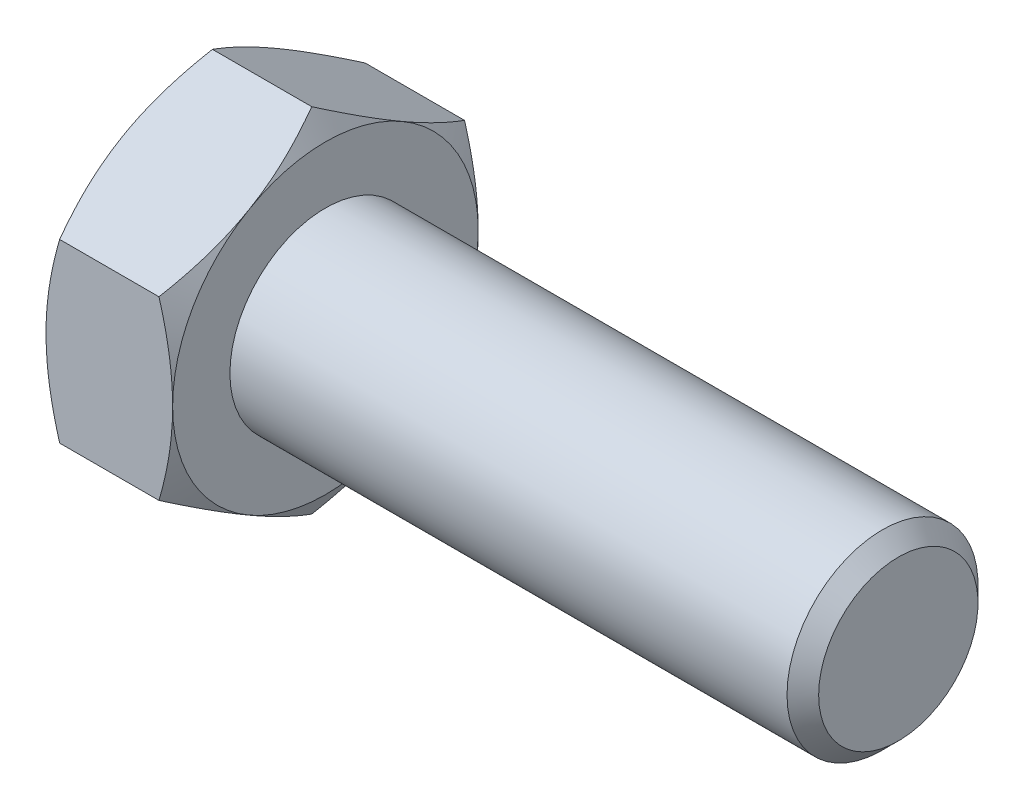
ISO-10303-21;
HEADER;
FILE_DESCRIPTION(('STEP AP214'),'2;1');
FILE_NAME('part.step','',(''),(''),'','','');
FILE_SCHEMA(('AUTOMOTIVE_DESIGN { 1 0 10303 214 1 1 1 1 }'));
ENDSEC;
DATA;
#1=APPLICATION_CONTEXT('core data for automotive mechanical design processes');
#2=APPLICATION_PROTOCOL_DEFINITION('international standard','automotive_design',2000,#1);
#3=PRODUCT_CONTEXT('',#1,'mechanical');
#4=PRODUCT('Part','Part','',(#3));
#5=PRODUCT_RELATED_PRODUCT_CATEGORY('part','',(#4));
#6=PRODUCT_DEFINITION_FORMATION('','',#4);
#7=PRODUCT_DEFINITION_CONTEXT('part definition',#1,'design');
#8=PRODUCT_DEFINITION('design','',#6,#7);
#9=PRODUCT_DEFINITION_SHAPE('','',#8);
#10=(LENGTH_UNIT() NAMED_UNIT(*) SI_UNIT(.MILLI.,.METRE.));
#11=(NAMED_UNIT(*) PLANE_ANGLE_UNIT() SI_UNIT($,.RADIAN.));
#12=(NAMED_UNIT(*) SI_UNIT($,.STERADIAN.) SOLID_ANGLE_UNIT());
#13=UNCERTAINTY_MEASURE_WITH_UNIT(LENGTH_MEASURE(1.E-05),#10,'distance_accuracy_value','');
#14=(GEOMETRIC_REPRESENTATION_CONTEXT(3) GLOBAL_UNCERTAINTY_ASSIGNED_CONTEXT((#13)) GLOBAL_UNIT_ASSIGNED_CONTEXT((#10,
#11,#12)) REPRESENTATION_CONTEXT('',''));
#15=CARTESIAN_POINT('',(0.,0.,0.));
#16=DIRECTION('',(0.,0.,1.));
#17=DIRECTION('',(1.,0.,0.));
#18=AXIS2_PLACEMENT_3D('',#15,#16,#17);
#19=CARTESIAN_POINT('',(6.63,4.618802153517,-8.));
#20=DIRECTION('',(0.,-0.866025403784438,0.500000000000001));
#21=DIRECTION('',(0.,-0.500000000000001,-0.866025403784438));
#22=AXIS2_PLACEMENT_3D('',#19,#20,#21);
#23=PLANE('',#22);
#24=CARTESIAN_POINT('',(5.91540215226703,4.61868668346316,-8.0002));
#25=CARTESIAN_POINT('',(5.97400928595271,4.72021302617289,-7.8243512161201));
#26=CARTESIAN_POINT('',(6.02995659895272,4.82211789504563,-7.64784680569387));
#27=CARTESIAN_POINT('',(6.13579899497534,5.02675523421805,-7.29340453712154));
#28=CARTESIAN_POINT('',(6.18569146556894,5.12948804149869,-7.11546609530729));
#29=CARTESIAN_POINT('',(6.32530720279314,5.43933133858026,-6.57880176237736));
#30=CARTESIAN_POINT('',(6.40471882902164,5.64766491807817,-6.21795741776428));
#31=CARTESIAN_POINT('',(6.49783835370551,5.95943209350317,-5.67796082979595));
#32=CARTESIAN_POINT('',(6.52436541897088,6.06193429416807,-5.50042181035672));
#33=CARTESIAN_POINT('',(6.56884682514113,6.26740224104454,-5.14454088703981));
#34=CARTESIAN_POINT('',(6.58680192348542,6.37036794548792,-4.96619905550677));
#35=CARTESIAN_POINT('',(6.61368435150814,6.57647664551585,-4.60920831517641));
#36=CARTESIAN_POINT('',(6.62262192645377,6.67961930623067,-4.4305599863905));
#37=CARTESIAN_POINT('',(6.63127769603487,6.88599991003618,-4.07309829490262));
#38=CARTESIAN_POINT('',(6.63099617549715,6.98923785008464,-3.89428493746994));
#39=CARTESIAN_POINT('',(6.62185497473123,7.18224506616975,-3.5599866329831));
#40=CARTESIAN_POINT('',(6.61411039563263,7.27202796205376,-3.40447809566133));
#41=CARTESIAN_POINT('',(6.59179886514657,7.45138347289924,-3.0938252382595));
#42=CARTESIAN_POINT('',(6.57723145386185,7.5409560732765,-2.93868094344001));
#43=CARTESIAN_POINT('',(6.52363930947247,7.80932710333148,-2.47384868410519));
#44=CARTESIAN_POINT('',(6.47473135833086,7.98765049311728,-2.16498351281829));
#45=CARTESIAN_POINT('',(6.35246059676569,8.34618890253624,-1.54397677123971));
#46=CARTESIAN_POINT('',(6.27857947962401,8.52635816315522,-1.23191445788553));
#47=CARTESIAN_POINT('',(6.11089985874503,8.88400987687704,-0.612443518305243));
#48=CARTESIAN_POINT('',(6.01714073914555,9.06149691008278,-0.30502695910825));
#49=CARTESIAN_POINT('',(5.91540215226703,9.23771977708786,0.000199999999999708));
#50=B_SPLINE_CURVE_WITH_KNOTS('',3,(#24,#25,#26,#27,#28,#29,#30,#31,#32,#33,#34,#35,#36,#37,#38,
#39,#40,#41,#42,#43,#44,#45,#46,#47,#48,#49),.UNSPECIFIED.,.F.,.F.,(4,2,2,2,2,2,2,2,2,2,2,2,4),
(0.,0.633973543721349,1.26821965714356,2.53934712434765,3.15934343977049,3.77928496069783,
4.39852133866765,5.01773858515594,5.55680239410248,6.09590254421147,7.17487077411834,
8.27776850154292,9.37850115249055),.UNSPECIFIED.);
#51=CARTESIAN_POINT('',(5.91546882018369,4.618802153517,-8.));
#52=VERTEX_POINT('',#51);
#53=CARTESIAN_POINT('',(6.63,6.92820323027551,-4.00000000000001));
#54=VERTEX_POINT('',#53);
#55=EDGE_CURVE('E261',#52,#54,#50,.T.);
#56=ORIENTED_EDGE('',*,*,#55,.F.);
#57=DIRECTION('',(-1.,0.,0.));
#58=VECTOR('',#57,1.);
#59=CARTESIAN_POINT('',(6.63,4.618802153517,-8.));
#60=LINE('',#59,#58);
#61=CARTESIAN_POINT('',(0.714531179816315,4.618802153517,-8.));
#62=VERTEX_POINT('',#61);
#63=EDGE_CURVE('E280',#52,#62,#60,.T.);
#64=ORIENTED_EDGE('',*,*,#63,.T.);
#65=CARTESIAN_POINT('',(0.714597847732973,9.23771977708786,0.0002));
#66=CARTESIAN_POINT('',(0.655990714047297,9.13619343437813,-0.175648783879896));
#67=CARTESIAN_POINT('',(0.60004340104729,9.03428856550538,-0.352153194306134));
#68=CARTESIAN_POINT('',(0.494201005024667,8.82965122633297,-0.706595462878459));
#69=CARTESIAN_POINT('',(0.444308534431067,8.72691841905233,-0.884533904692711));
#70=CARTESIAN_POINT('',(0.304692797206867,8.41707512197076,-1.42119823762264));
#71=CARTESIAN_POINT('',(0.225281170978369,8.20874154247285,-1.78204258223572));
#72=CARTESIAN_POINT('',(0.13216164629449,7.89697436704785,-2.32203917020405));
#73=CARTESIAN_POINT('',(0.105634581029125,7.79447216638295,-2.49957818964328));
#74=CARTESIAN_POINT('',(0.0611531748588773,7.58900421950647,-2.8554591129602));
#75=CARTESIAN_POINT('',(0.0431980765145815,7.4860385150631,-3.03380094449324));
#76=CARTESIAN_POINT('',(0.0163156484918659,7.27992981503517,-3.39079168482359));
#77=CARTESIAN_POINT('',(0.00737807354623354,7.17678715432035,-3.5694400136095));
#78=CARTESIAN_POINT('',(-0.00127769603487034,6.97040655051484,-3.92690170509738));
#79=CARTESIAN_POINT('',(-0.000996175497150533,6.86716861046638,-4.10571506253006));
#80=CARTESIAN_POINT('',(0.00814502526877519,6.67416139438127,-4.4400133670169));
#81=CARTESIAN_POINT('',(0.0158896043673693,6.58437849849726,-4.59552190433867));
#82=CARTESIAN_POINT('',(0.0382011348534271,6.40502298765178,-4.90617476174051));
#83=CARTESIAN_POINT('',(0.0527685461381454,6.31545038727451,-5.06131905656));
#84=CARTESIAN_POINT('',(0.106360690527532,6.04707935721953,-5.52615131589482));
#85=CARTESIAN_POINT('',(0.15526864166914,5.86875596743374,-5.83501648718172));
#86=CARTESIAN_POINT('',(0.277539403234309,5.51021755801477,-6.4560232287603));
#87=CARTESIAN_POINT('',(0.351420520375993,5.3300482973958,-6.76808554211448));
#88=CARTESIAN_POINT('',(0.519100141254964,4.97239658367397,-7.38755648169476));
#89=CARTESIAN_POINT('',(0.612859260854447,4.79490955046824,-7.69497304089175));
#90=CARTESIAN_POINT('',(0.714597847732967,4.61868668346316,-8.0002));
#91=B_SPLINE_CURVE_WITH_KNOTS('',3,(#65,#66,#67,#68,#69,#70,#71,#72,#73,#74,#75,#76,#77,#78,#79,
#80,#81,#82,#83,#84,#85,#86,#87,#88,#89,#90),.UNSPECIFIED.,.F.,.F.,(4,2,2,2,2,2,2,2,2,2,2,2,4),
(0.,0.633973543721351,1.26821965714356,2.53934712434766,3.15934343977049,3.77928496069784,
4.39852133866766,5.01773858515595,5.55680239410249,6.09590254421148,7.17487077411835,
8.27776850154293,9.37850115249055),.UNSPECIFIED.);
#92=CARTESIAN_POINT('',(0.,6.92820323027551,-4.00000000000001));
#93=VERTEX_POINT('',#92);
#94=EDGE_CURVE('E227',#93,#62,#91,.T.);
#95=ORIENTED_EDGE('',*,*,#94,.F.);
#96=CARTESIAN_POINT('',(0.714531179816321,9.23760430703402,0.));
#97=VERTEX_POINT('',#96);
#98=EDGE_CURVE('E54',#97,#93,#91,.T.);
#99=ORIENTED_EDGE('',*,*,#98,.F.);
#100=DIRECTION('',(-1.,0.,0.));
#101=VECTOR('',#100,1.);
#102=CARTESIAN_POINT('',(6.63,9.23760430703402,0.));
#103=LINE('',#102,#101);
#104=CARTESIAN_POINT('',(5.91546882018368,9.23760430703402,0.));
#105=VERTEX_POINT('',#104);
#106=EDGE_CURVE('E264',#105,#97,#103,.T.);
#107=ORIENTED_EDGE('',*,*,#106,.F.);
#108=EDGE_CURVE('E297',#54,#105,#50,.T.);
#109=ORIENTED_EDGE('',*,*,#108,.F.);
#110=EDGE_LOOP('',(#56,#64,#95,#99,#107,#109));
#111=FACE_BOUND('',#110,.T.);
#112=ADVANCED_FACE('F32',(#111),#23,.F.);
#113=CARTESIAN_POINT('',(6.63,9.23760430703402,0.));
#114=DIRECTION('',(0.,-0.866025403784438,-0.500000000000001));
#115=DIRECTION('',(0.,0.500000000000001,-0.866025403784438));
#116=AXIS2_PLACEMENT_3D('',#113,#114,#115);
#117=PLANE('',#116);
#118=CARTESIAN_POINT('',(5.91540215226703,9.23771977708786,-0.000200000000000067));
#119=CARTESIAN_POINT('',(5.9740092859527,9.13619343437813,0.175648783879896));
#120=CARTESIAN_POINT('',(6.02995659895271,9.03428856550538,0.352153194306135));
#121=CARTESIAN_POINT('',(6.13579899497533,8.82965122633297,0.70659546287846));
#122=CARTESIAN_POINT('',(6.18569146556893,8.72691841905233,0.884533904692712));
#123=CARTESIAN_POINT('',(6.32530720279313,8.41707512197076,1.42119823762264));
#124=CARTESIAN_POINT('',(6.40471882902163,8.20874154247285,1.78204258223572));
#125=CARTESIAN_POINT('',(6.49783835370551,7.89697436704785,2.32203917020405));
#126=CARTESIAN_POINT('',(6.52436541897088,7.79447216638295,2.49957818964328));
#127=CARTESIAN_POINT('',(6.56884682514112,7.58900421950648,2.8554591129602));
#128=CARTESIAN_POINT('',(6.58680192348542,7.4860385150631,3.03380094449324));
#129=CARTESIAN_POINT('',(6.61368435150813,7.27992981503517,3.39079168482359));
#130=CARTESIAN_POINT('',(6.62262192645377,7.17678715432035,3.5694400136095));
#131=CARTESIAN_POINT('',(6.63127769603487,6.97040655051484,3.92690170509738));
#132=CARTESIAN_POINT('',(6.63099617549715,6.86716861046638,4.10571506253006));
#133=CARTESIAN_POINT('',(6.62185497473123,6.67416139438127,4.4400133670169));
#134=CARTESIAN_POINT('',(6.61411039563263,6.58437849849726,4.59552190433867));
#135=CARTESIAN_POINT('',(6.59179886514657,6.40502298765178,4.90617476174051));
#136=CARTESIAN_POINT('',(6.57723145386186,6.31545038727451,5.06131905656));
#137=CARTESIAN_POINT('',(6.52363930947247,6.04707935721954,5.52615131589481));
#138=CARTESIAN_POINT('',(6.47473135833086,5.86875596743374,5.83501648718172));
#139=CARTESIAN_POINT('',(6.35246059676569,5.51021755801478,6.4560232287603));
#140=CARTESIAN_POINT('',(6.27857947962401,5.3300482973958,6.76808554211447));
#141=CARTESIAN_POINT('',(6.11089985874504,4.97239658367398,7.38755648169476));
#142=CARTESIAN_POINT('',(6.01714073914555,4.79490955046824,7.69497304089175));
#143=CARTESIAN_POINT('',(5.91540215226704,4.61868668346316,8.0002));
#144=B_SPLINE_CURVE_WITH_KNOTS('',3,(#118,#119,#120,#121,#122,#123,#124,#125,#126,#127,#128,
#129,#130,#131,#132,#133,#134,#135,#136,#137,#138,#139,#140,#141,#142,#143),.UNSPECIFIED.,.F.,
.F.,(4,2,2,2,2,2,2,2,2,2,2,2,4),(0.,0.633973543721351,1.26821965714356,2.53934712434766,
3.15934343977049,3.77928496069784,4.39852133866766,5.01773858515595,5.55680239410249,
6.09590254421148,7.17487077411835,8.27776850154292,9.37850115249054),.UNSPECIFIED.);
#145=CARTESIAN_POINT('',(6.63,6.92820323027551,4.00000000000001));
#146=VERTEX_POINT('',#145);
#147=EDGE_CURVE('E265',#105,#146,#144,.T.);
#148=ORIENTED_EDGE('',*,*,#147,.F.);
#149=ORIENTED_EDGE('',*,*,#106,.T.);
#150=CARTESIAN_POINT('',(0.714597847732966,4.61868668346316,8.0002));
#151=CARTESIAN_POINT('',(0.655990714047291,4.72021302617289,7.8243512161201));
#152=CARTESIAN_POINT('',(0.600043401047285,4.82211789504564,7.64784680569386));
#153=CARTESIAN_POINT('',(0.494201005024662,5.02675523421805,7.29340453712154));
#154=CARTESIAN_POINT('',(0.444308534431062,5.12948804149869,7.11546609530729));
#155=CARTESIAN_POINT('',(0.304692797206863,5.43933133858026,6.57880176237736));
#156=CARTESIAN_POINT('',(0.225281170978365,5.64766491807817,6.21795741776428));
#157=CARTESIAN_POINT('',(0.132161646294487,5.95943209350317,5.67796082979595));
#158=CARTESIAN_POINT('',(0.105634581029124,6.06193429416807,5.50042181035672));
#159=CARTESIAN_POINT('',(0.0611531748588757,6.26740224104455,5.1445408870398));
#160=CARTESIAN_POINT('',(0.0431980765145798,6.37036794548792,4.96619905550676));
#161=CARTESIAN_POINT('',(0.0163156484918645,6.57647664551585,4.60920831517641));
#162=CARTESIAN_POINT('',(0.00737807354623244,6.67961930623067,4.4305599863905));
#163=CARTESIAN_POINT('',(-0.00127769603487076,6.88599991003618,4.07309829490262));
#164=CARTESIAN_POINT('',(-0.000996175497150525,6.98923785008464,3.89428493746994));
#165=CARTESIAN_POINT('',(0.00814502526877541,7.18224506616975,3.5599866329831));
#166=CARTESIAN_POINT('',(0.0158896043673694,7.27202796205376,3.40447809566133));
#167=CARTESIAN_POINT('',(0.0382011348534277,7.45138347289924,3.09382523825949));
#168=CARTESIAN_POINT('',(0.0527685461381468,7.54095607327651,2.93868094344));
#169=CARTESIAN_POINT('',(0.106360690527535,7.80932710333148,2.47384868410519));
#170=CARTESIAN_POINT('',(0.155268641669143,7.98765049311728,2.16498351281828));
#171=CARTESIAN_POINT('',(0.277539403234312,8.34618890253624,1.5439767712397));
#172=CARTESIAN_POINT('',(0.351420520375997,8.52635816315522,1.23191445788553));
#173=CARTESIAN_POINT('',(0.519100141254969,8.88400987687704,0.612443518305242));
#174=CARTESIAN_POINT('',(0.612859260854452,9.06149691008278,0.30502695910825));
#175=CARTESIAN_POINT('',(0.714597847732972,9.23771977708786,-0.000200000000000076));
#176=B_SPLINE_CURVE_WITH_KNOTS('',3,(#150,#151,#152,#153,#154,#155,#156,#157,#158,#159,#160,
#161,#162,#163,#164,#165,#166,#167,#168,#169,#170,#171,#172,#173,#174,#175),.UNSPECIFIED.,.F.,
.F.,(4,2,2,2,2,2,2,2,2,2,2,2,4),(0.,0.633973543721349,1.26821965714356,2.53934712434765,
3.15934343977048,3.77928496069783,4.39852133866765,5.01773858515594,5.55680239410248,
6.09590254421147,7.17487077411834,8.27776850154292,9.37850115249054),.UNSPECIFIED.);
#177=CARTESIAN_POINT('',(0.,6.92820323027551,4.00000000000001));
#178=VERTEX_POINT('',#177);
#179=EDGE_CURVE('E192',#178,#97,#176,.T.);
#180=ORIENTED_EDGE('',*,*,#179,.F.);
#181=CARTESIAN_POINT('',(0.714531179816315,4.618802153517,8.));
#182=VERTEX_POINT('',#181);
#183=EDGE_CURVE('E240',#182,#178,#176,.T.);
#184=ORIENTED_EDGE('',*,*,#183,.F.);
#185=DIRECTION('',(-1.,0.,0.));
#186=VECTOR('',#185,1.);
#187=CARTESIAN_POINT('',(6.63,4.618802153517,8.));
#188=LINE('',#187,#186);
#189=CARTESIAN_POINT('',(5.91546882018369,4.618802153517,8.));
#190=VERTEX_POINT('',#189);
#191=EDGE_CURVE('E269',#190,#182,#188,.T.);
#192=ORIENTED_EDGE('',*,*,#191,.F.);
#193=EDGE_CURVE('E131',#146,#190,#144,.T.);
#194=ORIENTED_EDGE('',*,*,#193,.F.);
#195=EDGE_LOOP('',(#148,#149,#180,#184,#192,#194));
#196=FACE_BOUND('',#195,.T.);
#197=ADVANCED_FACE('F177',(#196),#117,.F.);
#198=CARTESIAN_POINT('',(6.63,4.618802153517,8.));
#199=DIRECTION('',(0.,0.,-1.));
#200=DIRECTION('',(0.,1.,0.));
#201=AXIS2_PLACEMENT_3D('',#198,#199,#200);
#202=PLANE('',#201);
#203=CARTESIAN_POINT('',(2.60509408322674,-12.6546855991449,8.));
#204=CARTESIAN_POINT('',(2.77661511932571,-12.3031246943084,8.));
#205=CARTESIAN_POINT('',(2.94656179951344,-11.9507829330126,8.));
#206=CARTESIAN_POINT('',(3.28242571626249,-11.2441233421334,8.));
#207=CARTESIAN_POINT('',(3.44834236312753,-10.8898052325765,8.));
#208=CARTESIAN_POINT('',(3.77604805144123,-10.177068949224,8.));
#209=CARTESIAN_POINT('',(3.93781174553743,-9.81863908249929,8.));
#210=CARTESIAN_POINT('',(4.25504272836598,-9.09901413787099,8.));
#211=CARTESIAN_POINT('',(4.41051029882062,-8.73781918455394,8.));
#212=CARTESIAN_POINT('',(4.71875090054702,-7.9995005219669,8.));
#213=CARTESIAN_POINT('',(4.87124323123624,-7.62225899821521,8.));
#214=CARTESIAN_POINT('',(5.16527588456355,-6.86345577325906,8.));
#215=CARTESIAN_POINT('',(5.306815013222,-6.48189360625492,8.));
#216=CARTESIAN_POINT('',(5.57540567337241,-5.71447512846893,8.));
#217=CARTESIAN_POINT('',(5.702484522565,-5.32862847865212,8.));
#218=CARTESIAN_POINT('',(5.93824278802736,-4.55141880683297,8.));
#219=CARTESIAN_POINT('',(6.04692774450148,-4.16005748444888,8.));
#220=CARTESIAN_POINT('',(6.240249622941,-3.37376378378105,8.));
#221=CARTESIAN_POINT('',(6.32502627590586,-2.97886668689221,8.));
#222=CARTESIAN_POINT('',(6.43072479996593,-2.38273452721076,8.));
#223=CARTESIAN_POINT('',(6.46238124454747,-2.18337977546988,8.));
#224=CARTESIAN_POINT('',(6.51792464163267,-1.78359737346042,8.));
#225=CARTESIAN_POINT('',(6.54181235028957,-1.58316982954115,8.));
#226=CARTESIAN_POINT('',(6.58102930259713,-1.18423541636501,8.));
#227=CARTESIAN_POINT('',(6.59647082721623,-0.985739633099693,8.));
#228=CARTESIAN_POINT('',(6.61893702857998,-0.588272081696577,8.));
#229=CARTESIAN_POINT('',(6.62596185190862,-0.389300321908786,8.));
#230=CARTESIAN_POINT('',(6.63142584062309,0.00876221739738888,8.));
#231=CARTESIAN_POINT('',(6.62986504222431,0.207852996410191,8.));
#232=CARTESIAN_POINT('',(6.61819857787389,0.605786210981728,8.));
#233=CARTESIAN_POINT('',(6.60809253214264,0.804628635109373,8.));
#234=CARTESIAN_POINT('',(6.57428346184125,1.27520492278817,8.));
#235=CARTESIAN_POINT('',(6.54693272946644,1.5466829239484,8.));
#236=CARTESIAN_POINT('',(6.47774076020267,2.08777093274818,8.));
#237=CARTESIAN_POINT('',(6.4358977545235,2.3573807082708,8.));
#238=CARTESIAN_POINT('',(6.29083680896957,3.16301775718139,7.99999999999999));
#239=CARTESIAN_POINT('',(6.16810870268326,3.69558689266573,8.));
#240=CARTESIAN_POINT('',(5.95341340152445,4.49226054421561,8.));
#241=CARTESIAN_POINT('',(5.87569814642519,4.76044513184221,8.));
#242=CARTESIAN_POINT('',(5.71172437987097,5.29421545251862,8.));
#243=CARTESIAN_POINT('',(5.62546580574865,5.55980116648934,8.));
#244=CARTESIAN_POINT('',(5.4458279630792,6.088448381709,8.));
#245=CARTESIAN_POINT('',(5.35245067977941,6.35151056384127,8.));
#246=CARTESIAN_POINT('',(5.15972074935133,6.87542422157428,8.));
#247=CARTESIAN_POINT('',(5.06036821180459,7.13627573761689,7.99999999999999));
#248=CARTESIAN_POINT('',(4.79938211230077,7.80218876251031,7.99999999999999));
#249=CARTESIAN_POINT('',(4.63414968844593,8.20583801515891,7.99999999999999));
#250=CARTESIAN_POINT('',(4.29439355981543,9.00922091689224,7.99999999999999));
#251=CARTESIAN_POINT('',(4.11986900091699,9.40895420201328,7.99999999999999));
#252=CARTESIAN_POINT('',(3.76358514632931,10.2053302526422,7.99999999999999));
#253=CARTESIAN_POINT('',(3.58182350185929,10.6019719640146,7.99999999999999));
#254=CARTESIAN_POINT('',(3.21268524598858,11.3926098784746,7.99999999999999));
#255=CARTESIAN_POINT('',(3.02530881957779,11.7866061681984,7.99999999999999));
#256=CARTESIAN_POINT('',(2.64582022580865,12.5730081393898,7.99999999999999));
#257=CARTESIAN_POINT('',(2.45370161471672,12.9654107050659,7.99999999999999));
#258=CARTESIAN_POINT('',(2.06586538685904,13.7484335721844,7.99999999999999));
#259=CARTESIAN_POINT('',(1.87014774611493,14.1390538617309,7.99999999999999));
#260=CARTESIAN_POINT('',(1.47582208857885,14.9187387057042,7.99999999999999));
#261=CARTESIAN_POINT('',(1.27721462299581,15.3078035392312,7.99999999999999));
#262=CARTESIAN_POINT('',(0.877587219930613,16.0846929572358,7.99999999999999));
#263=CARTESIAN_POINT('',(0.676567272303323,16.4725175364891,7.99999999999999));
#264=CARTESIAN_POINT('',(0.109768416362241,17.559169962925,7.99999999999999));
#265=CARTESIAN_POINT('',(-0.258266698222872,18.2568208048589,7.99999999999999));
#266=CARTESIAN_POINT('',(-0.999116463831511,19.6496204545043,7.99999999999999));
#267=CARTESIAN_POINT('',(-1.37193136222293,20.3447691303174,7.99999999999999));
#268=CARTESIAN_POINT('',(-2.11998840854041,21.7309493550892,7.99999999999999));
#269=CARTESIAN_POINT('',(-2.49521930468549,22.4219869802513,7.99999999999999));
#270=CARTESIAN_POINT('',(-3.06012626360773,23.4573861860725,7.99999999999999));
#271=CARTESIAN_POINT('',(-3.24876537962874,23.8023143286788,7.99999999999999));
#272=CARTESIAN_POINT('',(-3.62665983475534,24.4918322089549,7.99999999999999));
#273=CARTESIAN_POINT('',(-3.81591517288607,24.8364219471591,7.99999999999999));
#274=CARTESIAN_POINT('',(-4.00544144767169,25.1808626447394,7.99999999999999));
#275=B_SPLINE_CURVE_WITH_KNOTS('',3,(#203,#204,#205,#206,#207,#208,#209,#210,#211,#212,#213,
#214,#215,#216,#217,#218,#219,#220,#221,#222,#223,#224,#225,#226,#227,#228,#229,#230,#231,#232,
#233,#234,#235,#236,#237,#238,#239,#240,#241,#242,#243,#244,#245,#246,#247,#248,#249,#250,#251,
#252,#253,#254,#255,#256,#257,#258,#259,#260,#261,#262,#263,#264,#265,#266,#267,#268,#269,#270,
#271,#272,#273,#274),.UNSPECIFIED.,.F.,.F.,(4,2,2,2,2,2,2,2,2,2,2,2,2,2,2,2,2,2,2,2,2,2,2,2,2,2,
2,2,2,2,2,2,2,2,2,4),(0.,1.17352534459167,2.34722138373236,3.52689945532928,4.70652468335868,
5.92708318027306,7.14777454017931,8.36612013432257,9.58409810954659,10.7948027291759,
11.40023293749,12.0056041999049,12.6027191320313,13.1998236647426,13.7969256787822,
14.3940542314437,15.2121538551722,16.0303533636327,17.6675489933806,18.5051258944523,
19.3427089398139,20.180059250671,21.0173942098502,22.3257038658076,23.6341339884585,
24.9429922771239,26.2518074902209,27.5625113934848,28.8732240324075,30.1836898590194,
31.4941611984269,33.8604586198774,36.2268790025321,38.5858914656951,39.7653151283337,
40.9447369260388),.UNSPECIFIED.);
#276=CARTESIAN_POINT('',(6.63,0.,8.));
#277=VERTEX_POINT('',#276);
#278=EDGE_CURVE('E124',#190,#277,#275,.F.);
#279=ORIENTED_EDGE('',*,*,#278,.F.);
#280=ORIENTED_EDGE('',*,*,#191,.T.);
#281=CARTESIAN_POINT('',(4.02490591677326,-12.6546855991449,8.));
#282=CARTESIAN_POINT('',(3.85338488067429,-12.3031246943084,8.));
#283=CARTESIAN_POINT('',(3.68343820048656,-11.9507829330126,8.));
#284=CARTESIAN_POINT('',(3.34757428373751,-11.2441233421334,8.));
#285=CARTESIAN_POINT('',(3.18165763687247,-10.8898052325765,8.));
#286=CARTESIAN_POINT('',(2.85395194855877,-10.177068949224,8.));
#287=CARTESIAN_POINT('',(2.69218825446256,-9.8186390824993,8.));
#288=CARTESIAN_POINT('',(2.37495727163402,-9.09901413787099,8.));
#289=CARTESIAN_POINT('',(2.21948970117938,-8.73781918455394,8.));
#290=CARTESIAN_POINT('',(1.91124909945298,-7.9995005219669,8.));
#291=CARTESIAN_POINT('',(1.75875676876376,-7.62225899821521,8.));
#292=CARTESIAN_POINT('',(1.46472411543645,-6.86345577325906,8.));
#293=CARTESIAN_POINT('',(1.323184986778,-6.48189360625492,8.));
#294=CARTESIAN_POINT('',(1.05459432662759,-5.71447512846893,8.));
#295=CARTESIAN_POINT('',(0.927515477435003,-5.32862847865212,8.));
#296=CARTESIAN_POINT('',(0.691757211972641,-4.55141880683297,8.));
#297=CARTESIAN_POINT('',(0.583072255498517,-4.16005748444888,8.));
#298=CARTESIAN_POINT('',(0.389750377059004,-3.37376378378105,8.));
#299=CARTESIAN_POINT('',(0.304973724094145,-2.97886668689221,8.));
#300=CARTESIAN_POINT('',(0.199275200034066,-2.38273452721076,8.));
#301=CARTESIAN_POINT('',(0.167618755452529,-2.18337977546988,8.));
#302=CARTESIAN_POINT('',(0.112075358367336,-1.78359737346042,8.));
#303=CARTESIAN_POINT('',(0.0881876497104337,-1.58316982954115,8.));
#304=CARTESIAN_POINT('',(0.0489706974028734,-1.18423541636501,8.));
#305=CARTESIAN_POINT('',(0.0335291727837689,-0.985739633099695,8.));
#306=CARTESIAN_POINT('',(0.0110629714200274,-0.588272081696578,8.));
#307=CARTESIAN_POINT('',(0.0040381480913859,-0.389300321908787,8.));
#308=CARTESIAN_POINT('',(-0.00142584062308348,0.00876221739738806,8.));
#309=CARTESIAN_POINT('',(0.000134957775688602,0.207852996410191,8.));
#310=CARTESIAN_POINT('',(0.0118014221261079,0.605786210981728,8.));
#311=CARTESIAN_POINT('',(0.0219074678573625,0.804628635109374,8.));
#312=CARTESIAN_POINT('',(0.0557165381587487,1.27520492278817,8.));
#313=CARTESIAN_POINT('',(0.083067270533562,1.5466829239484,8.));
#314=CARTESIAN_POINT('',(0.15225923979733,2.08777093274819,8.));
#315=CARTESIAN_POINT('',(0.1941022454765,2.3573807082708,8.));
#316=CARTESIAN_POINT('',(0.33916319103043,3.16301775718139,7.99999999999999));
#317=CARTESIAN_POINT('',(0.461891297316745,3.69558689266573,8.));
#318=CARTESIAN_POINT('',(0.676586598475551,4.49226054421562,8.));
#319=CARTESIAN_POINT('',(0.754301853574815,4.76044513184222,8.));
#320=CARTESIAN_POINT('',(0.918275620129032,5.29421545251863,8.));
#321=CARTESIAN_POINT('',(1.00453419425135,5.55980116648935,8.));
#322=CARTESIAN_POINT('',(1.1841720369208,6.08844838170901,8.));
#323=CARTESIAN_POINT('',(1.27754932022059,6.35151056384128,8.));
#324=CARTESIAN_POINT('',(1.47027925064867,6.87542422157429,8.));
#325=CARTESIAN_POINT('',(1.56963178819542,7.1362757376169,7.99999999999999));
#326=CARTESIAN_POINT('',(1.83061788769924,7.80218876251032,7.99999999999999));
#327=CARTESIAN_POINT('',(1.99585031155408,8.20583801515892,7.99999999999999));
#328=CARTESIAN_POINT('',(2.33560644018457,9.00922091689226,7.99999999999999));
#329=CARTESIAN_POINT('',(2.51013099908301,9.40895420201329,7.99999999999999));
#330=CARTESIAN_POINT('',(2.86641485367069,10.2053302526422,7.99999999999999));
#331=CARTESIAN_POINT('',(3.04817649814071,10.6019719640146,7.99999999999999));
#332=CARTESIAN_POINT('',(3.41731475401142,11.3926098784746,7.99999999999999));
#333=CARTESIAN_POINT('',(3.60469118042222,11.7866061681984,7.99999999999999));
#334=CARTESIAN_POINT('',(3.98417977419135,12.5730081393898,7.99999999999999));
#335=CARTESIAN_POINT('',(4.17629838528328,12.9654107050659,7.99999999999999));
#336=CARTESIAN_POINT('',(4.56413461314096,13.7484335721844,7.99999999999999));
#337=CARTESIAN_POINT('',(4.75985225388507,14.1390538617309,7.99999999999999));
#338=CARTESIAN_POINT('',(5.15417791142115,14.9187387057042,7.99999999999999));
#339=CARTESIAN_POINT('',(5.35278537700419,15.3078035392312,7.99999999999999));
#340=CARTESIAN_POINT('',(5.75241278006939,16.0846929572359,7.99999999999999));
#341=CARTESIAN_POINT('',(5.95343272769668,16.4725175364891,7.99999999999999));
#342=CARTESIAN_POINT('',(6.52023158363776,17.559169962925,7.99999999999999));
#343=CARTESIAN_POINT('',(6.88826669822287,18.2568208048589,7.99999999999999));
#344=CARTESIAN_POINT('',(7.62911646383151,19.6496204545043,7.99999999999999));
#345=CARTESIAN_POINT('',(8.00193136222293,20.3447691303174,7.99999999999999));
#346=CARTESIAN_POINT('',(8.74998840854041,21.7309493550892,7.99999999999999));
#347=CARTESIAN_POINT('',(9.12521930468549,22.4219869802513,7.99999999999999));
#348=CARTESIAN_POINT('',(9.69012626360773,23.4573861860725,7.99999999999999));
#349=CARTESIAN_POINT('',(9.87876537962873,23.8023143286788,7.99999999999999));
#350=CARTESIAN_POINT('',(10.2566598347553,24.491832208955,7.99999999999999));
#351=CARTESIAN_POINT('',(10.4459151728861,24.8364219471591,7.99999999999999));
#352=CARTESIAN_POINT('',(10.6354414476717,25.1808626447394,7.99999999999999));
#353=B_SPLINE_CURVE_WITH_KNOTS('',3,(#281,#282,#283,#284,#285,#286,#287,#288,#289,#290,#291,
#292,#293,#294,#295,#296,#297,#298,#299,#300,#301,#302,#303,#304,#305,#306,#307,#308,#309,#310,
#311,#312,#313,#314,#315,#316,#317,#318,#319,#320,#321,#322,#323,#324,#325,#326,#327,#328,#329,
#330,#331,#332,#333,#334,#335,#336,#337,#338,#339,#340,#341,#342,#343,#344,#345,#346,#347,#348,
#349,#350,#351,#352),.UNSPECIFIED.,.F.,.F.,(4,2,2,2,2,2,2,2,2,2,2,2,2,2,2,2,2,2,2,2,2,2,2,2,2,2,
2,2,2,2,2,2,2,2,2,4),(0.,1.17352534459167,2.34722138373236,3.52689945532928,4.70652468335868,
5.92708318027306,7.14777454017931,8.36612013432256,9.58409810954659,10.7948027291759,
11.40023293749,12.0056041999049,12.6027191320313,13.1998236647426,13.7969256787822,
14.3940542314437,15.2121538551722,16.0303533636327,17.6675489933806,18.5051258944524,
19.3427089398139,20.180059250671,21.0173942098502,22.3257038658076,23.6341339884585,
24.9429922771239,26.2518074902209,27.5625113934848,28.8732240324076,30.1836898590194,
31.4941611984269,33.8604586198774,36.2268790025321,38.5858914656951,39.7653151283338,
40.9447369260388),.UNSPECIFIED.);
#354=CARTESIAN_POINT('',(0.,0.,8.));
#355=VERTEX_POINT('',#354);
#356=EDGE_CURVE('E183',#355,#182,#353,.T.);
#357=ORIENTED_EDGE('',*,*,#356,.F.);
#358=CARTESIAN_POINT('',(0.714531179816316,-4.618802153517,8.));
#359=VERTEX_POINT('',#358);
#360=EDGE_CURVE('E190',#359,#355,#353,.T.);
#361=ORIENTED_EDGE('',*,*,#360,.F.);
#362=DIRECTION('',(-1.,0.,0.));
#363=VECTOR('',#362,1.);
#364=CARTESIAN_POINT('',(6.63,-4.618802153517,8.));
#365=LINE('',#364,#363);
#366=CARTESIAN_POINT('',(5.91546882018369,-4.618802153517,8.));
#367=VERTEX_POINT('',#366);
#368=EDGE_CURVE('E153',#367,#359,#365,.T.);
#369=ORIENTED_EDGE('',*,*,#368,.F.);
#370=EDGE_CURVE('E135',#277,#367,#275,.F.);
#371=ORIENTED_EDGE('',*,*,#370,.F.);
#372=EDGE_LOOP('',(#279,#280,#357,#361,#369,#371));
#373=FACE_BOUND('',#372,.T.);
#374=ADVANCED_FACE('F151',(#373),#202,.F.);
#375=CARTESIAN_POINT('',(6.63,-9.23760430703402,0.));
#376=DIRECTION('',(0.,0.866025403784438,-0.500000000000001));
#377=DIRECTION('',(0.,0.500000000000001,0.866025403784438));
#378=AXIS2_PLACEMENT_3D('',#375,#376,#377);
#379=PLANE('',#378);
#380=CARTESIAN_POINT('',(5.91540215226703,-4.61868668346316,8.0002));
#381=CARTESIAN_POINT('',(5.97400928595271,-4.72021302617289,7.8243512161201));
#382=CARTESIAN_POINT('',(6.02995659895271,-4.82211789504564,7.64784680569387));
#383=CARTESIAN_POINT('',(6.13579899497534,-5.02675523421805,7.29340453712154));
#384=CARTESIAN_POINT('',(6.18569146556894,-5.12948804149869,7.11546609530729));
#385=CARTESIAN_POINT('',(6.32530720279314,-5.43933133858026,6.57880176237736));
#386=CARTESIAN_POINT('',(6.40471882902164,-5.64766491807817,6.21795741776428));
#387=CARTESIAN_POINT('',(6.49783835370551,-5.95943209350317,5.67796082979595));
#388=CARTESIAN_POINT('',(6.52436541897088,-6.06193429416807,5.50042181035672));
#389=CARTESIAN_POINT('',(6.56884682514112,-6.26740224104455,5.14454088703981));
#390=CARTESIAN_POINT('',(6.58680192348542,-6.37036794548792,4.96619905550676));
#391=CARTESIAN_POINT('',(6.61368435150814,-6.57647664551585,4.60920831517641));
#392=CARTESIAN_POINT('',(6.62262192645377,-6.67961930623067,4.4305599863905));
#393=CARTESIAN_POINT('',(6.63127769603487,-6.88599991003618,4.07309829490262));
#394=CARTESIAN_POINT('',(6.63099617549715,-6.98923785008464,3.89428493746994));
#395=CARTESIAN_POINT('',(6.62185497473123,-7.18224506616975,3.5599866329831));
#396=CARTESIAN_POINT('',(6.61411039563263,-7.27202796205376,3.40447809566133));
#397=CARTESIAN_POINT('',(6.59179886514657,-7.45138347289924,3.0938252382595));
#398=CARTESIAN_POINT('',(6.57723145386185,-7.5409560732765,2.93868094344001));
#399=CARTESIAN_POINT('',(6.52363930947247,-7.80932710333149,2.47384868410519));
#400=CARTESIAN_POINT('',(6.47473135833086,-7.98765049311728,2.16498351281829));
#401=CARTESIAN_POINT('',(6.35246059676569,-8.34618890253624,1.54397677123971));
#402=CARTESIAN_POINT('',(6.278579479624,-8.52635816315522,1.23191445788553));
#403=CARTESIAN_POINT('',(6.11089985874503,-8.88400987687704,0.612443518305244));
#404=CARTESIAN_POINT('',(6.01714073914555,-9.06149691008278,0.305026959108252));
#405=CARTESIAN_POINT('',(5.91540215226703,-9.23771977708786,-0.000199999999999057));
#406=B_SPLINE_CURVE_WITH_KNOTS('',3,(#380,#381,#382,#383,#384,#385,#386,#387,#388,#389,#390,
#391,#392,#393,#394,#395,#396,#397,#398,#399,#400,#401,#402,#403,#404,#405),.UNSPECIFIED.,.F.,
.F.,(4,2,2,2,2,2,2,2,2,2,2,2,4),(0.,0.633973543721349,1.26821965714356,2.53934712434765,
3.15934343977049,3.77928496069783,4.39852133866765,5.01773858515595,5.55680239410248,
6.09590254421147,7.17487077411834,8.27776850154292,9.37850115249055),.UNSPECIFIED.);
#407=CARTESIAN_POINT('',(6.63,-6.92820323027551,4.00000000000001));
#408=VERTEX_POINT('',#407);
#409=EDGE_CURVE('E142',#367,#408,#406,.T.);
#410=ORIENTED_EDGE('',*,*,#409,.F.);
#411=ORIENTED_EDGE('',*,*,#368,.T.);
#412=CARTESIAN_POINT('',(0.714597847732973,-9.23771977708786,-0.000199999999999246));
#413=CARTESIAN_POINT('',(0.655990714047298,-9.13619343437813,0.175648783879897));
#414=CARTESIAN_POINT('',(0.600043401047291,-9.03428856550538,0.352153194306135));
#415=CARTESIAN_POINT('',(0.494201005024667,-8.82965122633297,0.706595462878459));
#416=CARTESIAN_POINT('',(0.444308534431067,-8.72691841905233,0.884533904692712));
#417=CARTESIAN_POINT('',(0.304692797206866,-8.41707512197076,1.42119823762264));
#418=CARTESIAN_POINT('',(0.22528117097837,-8.20874154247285,1.78204258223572));
#419=CARTESIAN_POINT('',(0.13216164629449,-7.89697436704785,2.32203917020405));
#420=CARTESIAN_POINT('',(0.105634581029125,-7.79447216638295,2.49957818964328));
#421=CARTESIAN_POINT('',(0.0611531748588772,-7.58900421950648,2.8554591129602));
#422=CARTESIAN_POINT('',(0.0431980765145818,-7.4860385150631,3.03380094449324));
#423=CARTESIAN_POINT('',(0.0163156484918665,-7.27992981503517,3.39079168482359));
#424=CARTESIAN_POINT('',(0.00737807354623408,-7.17678715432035,3.5694400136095));
#425=CARTESIAN_POINT('',(-0.00127769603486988,-6.97040655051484,3.92690170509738));
#426=CARTESIAN_POINT('',(-0.000996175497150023,-6.86716861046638,4.10571506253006));
#427=CARTESIAN_POINT('',(0.00814502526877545,-6.67416139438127,4.4400133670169));
#428=CARTESIAN_POINT('',(0.0158896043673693,-6.58437849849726,4.59552190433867));
#429=CARTESIAN_POINT('',(0.0382011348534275,-6.40502298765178,4.90617476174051));
#430=CARTESIAN_POINT('',(0.0527685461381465,-6.31545038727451,5.06131905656));
#431=CARTESIAN_POINT('',(0.106360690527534,-6.04707935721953,5.52615131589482));
#432=CARTESIAN_POINT('',(0.155268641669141,-5.86875596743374,5.83501648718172));
#433=CARTESIAN_POINT('',(0.277539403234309,-5.51021755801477,6.4560232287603));
#434=CARTESIAN_POINT('',(0.351420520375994,-5.3300482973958,6.76808554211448));
#435=CARTESIAN_POINT('',(0.519100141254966,-4.97239658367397,7.38755648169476));
#436=CARTESIAN_POINT('',(0.612859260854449,-4.79490955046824,7.69497304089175));
#437=CARTESIAN_POINT('',(0.714597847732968,-4.61868668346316,8.0002));
#438=B_SPLINE_CURVE_WITH_KNOTS('',3,(#412,#413,#414,#415,#416,#417,#418,#419,#420,#421,#422,
#423,#424,#425,#426,#427,#428,#429,#430,#431,#432,#433,#434,#435,#436,#437),.UNSPECIFIED.,.F.,
.F.,(4,2,2,2,2,2,2,2,2,2,2,2,4),(0.,0.63397354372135,1.26821965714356,2.53934712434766,
3.15934343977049,3.77928496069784,4.39852133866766,5.01773858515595,5.55680239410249,
6.09590254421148,7.17487077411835,8.27776850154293,9.37850115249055),.UNSPECIFIED.);
#439=CARTESIAN_POINT('',(0.,-6.92820323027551,4.00000000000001));
#440=VERTEX_POINT('',#439);
#441=EDGE_CURVE('E191',#440,#359,#438,.T.);
#442=ORIENTED_EDGE('',*,*,#441,.F.);
#443=CARTESIAN_POINT('',(0.714531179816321,-9.23760430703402,0.));
#444=VERTEX_POINT('',#443);
#445=EDGE_CURVE('E231',#444,#440,#438,.T.);
#446=ORIENTED_EDGE('',*,*,#445,.F.);
#447=DIRECTION('',(-1.,0.,0.));
#448=VECTOR('',#447,1.);
#449=CARTESIAN_POINT('',(6.63,-9.23760430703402,0.));
#450=LINE('',#449,#448);
#451=CARTESIAN_POINT('',(5.91546882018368,-9.23760430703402,0.));
#452=VERTEX_POINT('',#451);
#453=EDGE_CURVE('E276',#452,#444,#450,.T.);
#454=ORIENTED_EDGE('',*,*,#453,.F.);
#455=EDGE_CURVE('E154',#408,#452,#406,.T.);
#456=ORIENTED_EDGE('',*,*,#455,.F.);
#457=EDGE_LOOP('',(#410,#411,#442,#446,#454,#456));
#458=FACE_BOUND('',#457,.T.);
#459=ADVANCED_FACE('F176',(#458),#379,.F.);
#460=CARTESIAN_POINT('',(6.63,-4.61880215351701,-8.));
#461=DIRECTION('',(0.,0.866025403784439,0.5));
#462=DIRECTION('',(0.,-0.5,0.866025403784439));
#463=AXIS2_PLACEMENT_3D('',#460,#461,#462);
#464=PLANE('',#463);
#465=CARTESIAN_POINT('',(5.91540215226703,-9.23771977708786,0.000200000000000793));
#466=CARTESIAN_POINT('',(5.9740092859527,-9.13619343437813,-0.175648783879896));
#467=CARTESIAN_POINT('',(6.02995659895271,-9.03428856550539,-0.352153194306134));
#468=CARTESIAN_POINT('',(6.13579899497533,-8.82965122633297,-0.706595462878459));
#469=CARTESIAN_POINT('',(6.18569146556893,-8.72691841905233,-0.884533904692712));
#470=CARTESIAN_POINT('',(6.32530720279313,-8.41707512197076,-1.42119823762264));
#471=CARTESIAN_POINT('',(6.40471882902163,-8.20874154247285,-1.78204258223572));
#472=CARTESIAN_POINT('',(6.49783835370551,-7.89697436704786,-2.32203917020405));
#473=CARTESIAN_POINT('',(6.52436541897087,-7.79447216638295,-2.49957818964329));
#474=CARTESIAN_POINT('',(6.56884682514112,-7.58900421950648,-2.8554591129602));
#475=CARTESIAN_POINT('',(6.58680192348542,-7.48603851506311,-3.03380094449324));
#476=CARTESIAN_POINT('',(6.61368435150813,-7.27992981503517,-3.39079168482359));
#477=CARTESIAN_POINT('',(6.62262192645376,-7.17678715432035,-3.5694400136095));
#478=CARTESIAN_POINT('',(6.63127769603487,-6.97040655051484,-3.92690170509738));
#479=CARTESIAN_POINT('',(6.63099617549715,-6.86716861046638,-4.10571506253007));
#480=CARTESIAN_POINT('',(6.62185497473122,-6.67416139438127,-4.44001336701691));
#481=CARTESIAN_POINT('',(6.61411039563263,-6.58437849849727,-4.59552190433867));
#482=CARTESIAN_POINT('',(6.59179886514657,-6.40502298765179,-4.90617476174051));
#483=CARTESIAN_POINT('',(6.57723145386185,-6.31545038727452,-5.06131905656));
#484=CARTESIAN_POINT('',(6.52363930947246,-6.04707935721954,-5.52615131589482));
#485=CARTESIAN_POINT('',(6.47473135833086,-5.86875596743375,-5.83501648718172));
#486=CARTESIAN_POINT('',(6.35246059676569,-5.51021755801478,-6.4560232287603));
#487=CARTESIAN_POINT('',(6.278579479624,-5.33004829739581,-6.76808554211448));
#488=CARTESIAN_POINT('',(6.11089985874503,-4.97239658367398,-7.38755648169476));
#489=CARTESIAN_POINT('',(6.01714073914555,-4.79490955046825,-7.69497304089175));
#490=CARTESIAN_POINT('',(5.91540215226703,-4.61868668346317,-8.0002));
#491=B_SPLINE_CURVE_WITH_KNOTS('',3,(#465,#466,#467,#468,#469,#470,#471,#472,#473,#474,#475,
#476,#477,#478,#479,#480,#481,#482,#483,#484,#485,#486,#487,#488,#489,#490),.UNSPECIFIED.,.F.,
.F.,(4,2,2,2,2,2,2,2,2,2,2,2,4),(0.,0.63397354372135,1.26821965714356,2.53934712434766,
3.15934343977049,3.77928496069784,4.39852133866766,5.01773858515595,5.55680239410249,
6.09590254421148,7.17487077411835,8.27776850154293,9.37850115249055),.UNSPECIFIED.);
#492=CARTESIAN_POINT('',(6.63,-6.92820323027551,-4.));
#493=VERTEX_POINT('',#492);
#494=EDGE_CURVE('E520',#452,#493,#491,.T.);
#495=ORIENTED_EDGE('',*,*,#494,.F.);
#496=ORIENTED_EDGE('',*,*,#453,.T.);
#497=CARTESIAN_POINT('',(0.714597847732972,-4.61868668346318,-8.0002));
#498=CARTESIAN_POINT('',(0.655990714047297,-4.7202130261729,-7.82435121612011));
#499=CARTESIAN_POINT('',(0.60004340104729,-4.82211789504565,-7.64784680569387));
#500=CARTESIAN_POINT('',(0.494201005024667,-5.02675523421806,-7.29340453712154));
#501=CARTESIAN_POINT('',(0.444308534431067,-5.1294880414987,-7.11546609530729));
#502=CARTESIAN_POINT('',(0.304692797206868,-5.43933133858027,-6.57880176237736));
#503=CARTESIAN_POINT('',(0.22528117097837,-5.64766491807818,-6.21795741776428));
#504=CARTESIAN_POINT('',(0.132161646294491,-5.95943209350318,-5.67796082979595));
#505=CARTESIAN_POINT('',(0.105634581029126,-6.06193429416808,-5.50042181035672));
#506=CARTESIAN_POINT('',(0.0611531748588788,-6.26740224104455,-5.1445408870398));
#507=CARTESIAN_POINT('',(0.0431980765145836,-6.37036794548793,-4.96619905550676));
#508=CARTESIAN_POINT('',(0.0163156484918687,-6.57647664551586,-4.60920831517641));
#509=CARTESIAN_POINT('',(0.00737807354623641,-6.67961930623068,-4.4305599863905));
#510=CARTESIAN_POINT('',(-0.00127769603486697,-6.88599991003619,-4.07309829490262));
#511=CARTESIAN_POINT('',(-0.000996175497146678,-6.98923785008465,-3.89428493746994));
#512=CARTESIAN_POINT('',(0.00814502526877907,-7.18224506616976,-3.5599866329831));
#513=CARTESIAN_POINT('',(0.0158896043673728,-7.27202796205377,-3.40447809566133));
#514=CARTESIAN_POINT('',(0.0382011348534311,-7.45138347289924,-3.09382523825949));
#515=CARTESIAN_POINT('',(0.0527685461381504,-7.54095607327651,-2.93868094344));
#516=CARTESIAN_POINT('',(0.106360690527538,-7.80932710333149,-2.47384868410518));
#517=CARTESIAN_POINT('',(0.155268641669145,-7.98765049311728,-2.16498351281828));
#518=CARTESIAN_POINT('',(0.277539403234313,-8.34618890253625,-1.5439767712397));
#519=CARTESIAN_POINT('',(0.351420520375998,-8.52635816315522,-1.23191445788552));
#520=CARTESIAN_POINT('',(0.51910014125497,-8.88400987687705,-0.612443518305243));
#521=CARTESIAN_POINT('',(0.612859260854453,-9.06149691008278,-0.30502695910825));
#522=CARTESIAN_POINT('',(0.714597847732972,-9.23771977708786,0.000200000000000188));
#523=B_SPLINE_CURVE_WITH_KNOTS('',3,(#497,#498,#499,#500,#501,#502,#503,#504,#505,#506,#507,
#508,#509,#510,#511,#512,#513,#514,#515,#516,#517,#518,#519,#520,#521,#522),.UNSPECIFIED.,.F.,
.F.,(4,2,2,2,2,2,2,2,2,2,2,2,4),(0.,0.63397354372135,1.26821965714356,2.53934712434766,
3.15934343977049,3.77928496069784,4.39852133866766,5.01773858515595,5.55680239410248,
6.09590254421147,7.17487077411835,8.27776850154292,9.37850115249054),.UNSPECIFIED.);
#524=CARTESIAN_POINT('',(0.,-6.92820323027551,-4.));
#525=VERTEX_POINT('',#524);
#526=EDGE_CURVE('E235',#525,#444,#523,.T.);
#527=ORIENTED_EDGE('',*,*,#526,.F.);
#528=CARTESIAN_POINT('',(0.714531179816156,-4.61880215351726,-8.));
#529=VERTEX_POINT('',#528);
#530=EDGE_CURVE('E221',#529,#525,#523,.T.);
#531=ORIENTED_EDGE('',*,*,#530,.F.);
#532=DIRECTION('',(-1.,0.,0.));
#533=VECTOR('',#532,1.);
#534=CARTESIAN_POINT('',(6.63,-4.61880215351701,-8.));
#535=LINE('',#534,#533);
#536=CARTESIAN_POINT('',(5.91546882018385,-4.61880215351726,-8.));
#537=VERTEX_POINT('',#536);
#538=EDGE_CURVE('E278',#537,#529,#535,.T.);
#539=ORIENTED_EDGE('',*,*,#538,.F.);
#540=EDGE_CURVE('E516',#493,#537,#491,.T.);
#541=ORIENTED_EDGE('',*,*,#540,.F.);
#542=EDGE_LOOP('',(#495,#496,#527,#531,#539,#541));
#543=FACE_BOUND('',#542,.T.);
#544=ADVANCED_FACE('F324',(#543),#464,.F.);
#545=CARTESIAN_POINT('',(6.63,4.618802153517,-8.));
#546=DIRECTION('',(0.,0.,1.));
#547=DIRECTION('',(0.,-1.,0.));
#548=AXIS2_PLACEMENT_3D('',#545,#546,#547);
#549=PLANE('',#548);
#550=CARTESIAN_POINT('',(2.60509408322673,-12.6546855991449,-8.));
#551=CARTESIAN_POINT('',(2.7766151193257,-12.3031246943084,-8.));
#552=CARTESIAN_POINT('',(2.94656179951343,-11.9507829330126,-8.));
#553=CARTESIAN_POINT('',(3.28242571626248,-11.2441233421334,-8.));
#554=CARTESIAN_POINT('',(3.44834236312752,-10.8898052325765,-8.));
#555=CARTESIAN_POINT('',(3.77604805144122,-10.177068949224,-8.));
#556=CARTESIAN_POINT('',(3.93781174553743,-9.81863908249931,-8.));
#557=CARTESIAN_POINT('',(4.25504272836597,-9.09901413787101,-8.));
#558=CARTESIAN_POINT('',(4.41051029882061,-8.73781918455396,-8.));
#559=CARTESIAN_POINT('',(4.71875090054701,-7.99950052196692,-8.));
#560=CARTESIAN_POINT('',(4.87124323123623,-7.62225899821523,-8.));
#561=CARTESIAN_POINT('',(5.16527588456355,-6.86345577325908,-8.));
#562=CARTESIAN_POINT('',(5.306815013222,-6.48189360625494,-8.));
#563=CARTESIAN_POINT('',(5.5754056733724,-5.71447512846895,-8.));
#564=CARTESIAN_POINT('',(5.70248452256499,-5.32862847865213,-8.));
#565=CARTESIAN_POINT('',(5.93824278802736,-4.55141880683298,-8.));
#566=CARTESIAN_POINT('',(6.04692774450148,-4.16005748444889,-8.));
#567=CARTESIAN_POINT('',(6.24024962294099,-3.37376378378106,-8.));
#568=CARTESIAN_POINT('',(6.32502627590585,-2.97886668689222,-8.));
#569=CARTESIAN_POINT('',(6.43072479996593,-2.38273452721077,-8.));
#570=CARTESIAN_POINT('',(6.46238124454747,-2.18337977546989,-8.));
#571=CARTESIAN_POINT('',(6.51792464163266,-1.78359737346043,-8.));
#572=CARTESIAN_POINT('',(6.54181235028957,-1.58316982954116,-8.));
#573=CARTESIAN_POINT('',(6.58102930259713,-1.18423541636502,-8.));
#574=CARTESIAN_POINT('',(6.59647082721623,-0.985739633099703,-8.));
#575=CARTESIAN_POINT('',(6.61893702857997,-0.588272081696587,-8.));
#576=CARTESIAN_POINT('',(6.62596185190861,-0.389300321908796,-8.));
#577=CARTESIAN_POINT('',(6.63142584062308,0.00876221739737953,-8.));
#578=CARTESIAN_POINT('',(6.62986504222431,0.207852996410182,-8.));
#579=CARTESIAN_POINT('',(6.61819857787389,0.60578621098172,-8.));
#580=CARTESIAN_POINT('',(6.60809253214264,0.804628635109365,-8.));
#581=CARTESIAN_POINT('',(6.57428346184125,1.27520492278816,-8.));
#582=CARTESIAN_POINT('',(6.54693272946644,1.54668292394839,-8.));
#583=CARTESIAN_POINT('',(6.47774076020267,2.08777093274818,-8.));
#584=CARTESIAN_POINT('',(6.4358977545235,2.35738070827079,-8.));
#585=CARTESIAN_POINT('',(6.29083680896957,3.16301775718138,-8.));
#586=CARTESIAN_POINT('',(6.16810870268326,3.69558689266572,-8.));
#587=CARTESIAN_POINT('',(5.95341340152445,4.4922605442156,-8.));
#588=CARTESIAN_POINT('',(5.87569814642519,4.7604451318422,-8.));
#589=CARTESIAN_POINT('',(5.71172437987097,5.29421545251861,-8.));
#590=CARTESIAN_POINT('',(5.62546580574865,5.55980116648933,-8.));
#591=CARTESIAN_POINT('',(5.4458279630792,6.08844838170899,-8.));
#592=CARTESIAN_POINT('',(5.35245067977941,6.35151056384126,-8.));
#593=CARTESIAN_POINT('',(5.15972074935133,6.87542422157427,-8.));
#594=CARTESIAN_POINT('',(5.06036821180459,7.13627573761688,-8.));
#595=CARTESIAN_POINT('',(4.79938211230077,7.8021887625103,-8.));
#596=CARTESIAN_POINT('',(4.63414968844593,8.2058380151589,-8.));
#597=CARTESIAN_POINT('',(4.29439355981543,9.00922091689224,-8.));
#598=CARTESIAN_POINT('',(4.11986900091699,9.40895420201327,-8.));
#599=CARTESIAN_POINT('',(3.76358514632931,10.2053302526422,-8.));
#600=CARTESIAN_POINT('',(3.58182350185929,10.6019719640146,-8.));
#601=CARTESIAN_POINT('',(3.21268524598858,11.3926098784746,-8.));
#602=CARTESIAN_POINT('',(3.02530881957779,11.7866061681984,-8.));
#603=CARTESIAN_POINT('',(2.64582022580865,12.5730081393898,-8.));
#604=CARTESIAN_POINT('',(2.45370161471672,12.9654107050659,-8.));
#605=CARTESIAN_POINT('',(2.06586538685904,13.7484335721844,-8.));
#606=CARTESIAN_POINT('',(1.87014774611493,14.1390538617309,-8.));
#607=CARTESIAN_POINT('',(1.47582208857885,14.9187387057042,-8.));
#608=CARTESIAN_POINT('',(1.2772146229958,15.3078035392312,-8.));
#609=CARTESIAN_POINT('',(0.877587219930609,16.0846929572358,-8.));
#610=CARTESIAN_POINT('',(0.676567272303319,16.4725175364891,-8.));
#611=CARTESIAN_POINT('',(0.109768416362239,17.559169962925,-8.));
#612=CARTESIAN_POINT('',(-0.258266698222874,18.2568208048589,-8.));
#613=CARTESIAN_POINT('',(-0.999116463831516,19.6496204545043,-8.));
#614=CARTESIAN_POINT('',(-1.37193136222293,20.3447691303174,-8.));
#615=CARTESIAN_POINT('',(-2.11998840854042,21.7309493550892,-8.));
#616=CARTESIAN_POINT('',(-2.4952193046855,22.4219869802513,-8.));
#617=CARTESIAN_POINT('',(-3.06012626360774,23.4573861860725,-8.));
#618=CARTESIAN_POINT('',(-3.24876537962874,23.8023143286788,-8.));
#619=CARTESIAN_POINT('',(-3.62665983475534,24.491832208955,-8.));
#620=CARTESIAN_POINT('',(-3.81591517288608,24.8364219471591,-8.));
#621=CARTESIAN_POINT('',(-4.0054414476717,25.1808626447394,-8.));
#622=B_SPLINE_CURVE_WITH_KNOTS('',3,(#550,#551,#552,#553,#554,#555,#556,#557,#558,#559,#560,
#561,#562,#563,#564,#565,#566,#567,#568,#569,#570,#571,#572,#573,#574,#575,#576,#577,#578,#579,
#580,#581,#582,#583,#584,#585,#586,#587,#588,#589,#590,#591,#592,#593,#594,#595,#596,#597,#598,
#599,#600,#601,#602,#603,#604,#605,#606,#607,#608,#609,#610,#611,#612,#613,#614,#615,#616,#617,
#618,#619,#620,#621),.UNSPECIFIED.,.F.,.F.,(4,2,2,2,2,2,2,2,2,2,2,2,2,2,2,2,2,2,2,2,2,2,2,2,2,2,
2,2,2,2,2,2,2,2,2,4),(0.,1.17352534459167,2.34722138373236,3.52689945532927,4.70652468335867,
5.92708318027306,7.14777454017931,8.36612013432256,9.58409810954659,10.7948027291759,
11.40023293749,12.0056041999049,12.6027191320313,13.1998236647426,13.7969256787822,
14.3940542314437,15.2121538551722,16.0303533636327,17.6675489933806,18.5051258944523,
19.3427089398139,20.180059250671,21.0173942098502,22.3257038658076,23.6341339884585,
24.9429922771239,26.2518074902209,27.5625113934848,28.8732240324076,30.1836898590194,
31.4941611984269,33.8604586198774,36.2268790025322,38.5858914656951,39.7653151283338,
40.9447369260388),.UNSPECIFIED.);
#623=CARTESIAN_POINT('',(6.63,0.,-8.));
#624=VERTEX_POINT('',#623);
#625=EDGE_CURVE('E515',#537,#624,#622,.T.);
#626=ORIENTED_EDGE('',*,*,#625,.F.);
#627=ORIENTED_EDGE('',*,*,#538,.T.);
#628=CARTESIAN_POINT('',(4.02490591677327,-12.6546855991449,-8.));
#629=CARTESIAN_POINT('',(3.85338488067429,-12.3031246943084,-8.));
#630=CARTESIAN_POINT('',(3.68343820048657,-11.9507829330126,-8.));
#631=CARTESIAN_POINT('',(3.34757428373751,-11.2441233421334,-8.));
#632=CARTESIAN_POINT('',(3.18165763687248,-10.8898052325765,-8.));
#633=CARTESIAN_POINT('',(2.85395194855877,-10.177068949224,-8.));
#634=CARTESIAN_POINT('',(2.69218825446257,-9.81863908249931,-8.));
#635=CARTESIAN_POINT('',(2.37495727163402,-9.099014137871,-8.));
#636=CARTESIAN_POINT('',(2.21948970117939,-8.73781918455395,-8.));
#637=CARTESIAN_POINT('',(1.91124909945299,-7.99950052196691,-8.));
#638=CARTESIAN_POINT('',(1.75875676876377,-7.62225899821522,-8.));
#639=CARTESIAN_POINT('',(1.46472411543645,-6.86345577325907,-8.));
#640=CARTESIAN_POINT('',(1.323184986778,-6.48189360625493,-8.));
#641=CARTESIAN_POINT('',(1.0545943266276,-5.71447512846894,-8.));
#642=CARTESIAN_POINT('',(0.927515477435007,-5.32862847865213,-8.));
#643=CARTESIAN_POINT('',(0.691757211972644,-4.55141880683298,-8.));
#644=CARTESIAN_POINT('',(0.58307225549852,-4.16005748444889,-8.));
#645=CARTESIAN_POINT('',(0.389750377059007,-3.37376378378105,-8.));
#646=CARTESIAN_POINT('',(0.304973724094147,-2.97886668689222,-8.));
#647=CARTESIAN_POINT('',(0.199275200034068,-2.38273452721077,-8.));
#648=CARTESIAN_POINT('',(0.167618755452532,-2.18337977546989,-8.));
#649=CARTESIAN_POINT('',(0.112075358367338,-1.78359737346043,-8.));
#650=CARTESIAN_POINT('',(0.0881876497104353,-1.58316982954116,-8.));
#651=CARTESIAN_POINT('',(0.0489706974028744,-1.18423541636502,-8.));
#652=CARTESIAN_POINT('',(0.03352917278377,-0.985739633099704,-8.));
#653=CARTESIAN_POINT('',(0.0110629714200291,-0.588272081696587,-8.));
#654=CARTESIAN_POINT('',(0.00403814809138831,-0.389300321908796,-8.));
#655=CARTESIAN_POINT('',(-0.00142584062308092,0.00876221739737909,-8.));
#656=CARTESIAN_POINT('',(0.000134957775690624,0.207852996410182,-8.));
#657=CARTESIAN_POINT('',(0.011801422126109,0.605786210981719,-8.));
#658=CARTESIAN_POINT('',(0.0219074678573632,0.804628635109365,-8.));
#659=CARTESIAN_POINT('',(0.0557165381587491,1.27520492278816,-8.));
#660=CARTESIAN_POINT('',(0.0830672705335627,1.54668292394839,-8.));
#661=CARTESIAN_POINT('',(0.15225923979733,2.08777093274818,-8.));
#662=CARTESIAN_POINT('',(0.1941022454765,2.35738070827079,-8.));
#663=CARTESIAN_POINT('',(0.339163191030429,3.16301775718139,-8.));
#664=CARTESIAN_POINT('',(0.461891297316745,3.69558689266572,-8.));
#665=CARTESIAN_POINT('',(0.676586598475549,4.4922605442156,-8.));
#666=CARTESIAN_POINT('',(0.754301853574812,4.7604451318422,-8.));
#667=CARTESIAN_POINT('',(0.918275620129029,5.29421545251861,-8.));
#668=CARTESIAN_POINT('',(1.00453419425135,5.55980116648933,-8.));
#669=CARTESIAN_POINT('',(1.1841720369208,6.088448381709,-8.));
#670=CARTESIAN_POINT('',(1.27754932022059,6.35151056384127,-8.));
#671=CARTESIAN_POINT('',(1.47027925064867,6.87542422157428,-8.));
#672=CARTESIAN_POINT('',(1.56963178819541,7.13627573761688,-8.));
#673=CARTESIAN_POINT('',(1.83061788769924,7.80218876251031,-8.));
#674=CARTESIAN_POINT('',(1.99585031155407,8.20583801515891,-8.));
#675=CARTESIAN_POINT('',(2.33560644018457,9.00922091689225,-8.));
#676=CARTESIAN_POINT('',(2.51013099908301,9.40895420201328,-8.));
#677=CARTESIAN_POINT('',(2.86641485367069,10.2053302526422,-8.));
#678=CARTESIAN_POINT('',(3.04817649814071,10.6019719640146,-8.));
#679=CARTESIAN_POINT('',(3.41731475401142,11.3926098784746,-8.));
#680=CARTESIAN_POINT('',(3.60469118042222,11.7866061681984,-8.));
#681=CARTESIAN_POINT('',(3.98417977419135,12.5730081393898,-8.));
#682=CARTESIAN_POINT('',(4.17629838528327,12.9654107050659,-8.));
#683=CARTESIAN_POINT('',(4.56413461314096,13.7484335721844,-8.));
#684=CARTESIAN_POINT('',(4.75985225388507,14.1390538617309,-8.));
#685=CARTESIAN_POINT('',(5.15417791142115,14.9187387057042,-8.));
#686=CARTESIAN_POINT('',(5.35278537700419,15.3078035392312,-8.));
#687=CARTESIAN_POINT('',(5.75241278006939,16.0846929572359,-8.));
#688=CARTESIAN_POINT('',(5.95343272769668,16.4725175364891,-8.));
#689=CARTESIAN_POINT('',(6.52023158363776,17.559169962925,-8.));
#690=CARTESIAN_POINT('',(6.88826669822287,18.2568208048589,-8.));
#691=CARTESIAN_POINT('',(7.62911646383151,19.6496204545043,-8.));
#692=CARTESIAN_POINT('',(8.00193136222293,20.3447691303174,-8.));
#693=CARTESIAN_POINT('',(8.74998840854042,21.7309493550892,-8.));
#694=CARTESIAN_POINT('',(9.12521930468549,22.4219869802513,-8.));
#695=CARTESIAN_POINT('',(9.69012626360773,23.4573861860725,-8.));
#696=CARTESIAN_POINT('',(9.87876537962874,23.8023143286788,-8.));
#697=CARTESIAN_POINT('',(10.2566598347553,24.491832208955,-8.));
#698=CARTESIAN_POINT('',(10.4459151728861,24.8364219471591,-8.));
#699=CARTESIAN_POINT('',(10.6354414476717,25.1808626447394,-8.));
#700=B_SPLINE_CURVE_WITH_KNOTS('',3,(#628,#629,#630,#631,#632,#633,#634,#635,#636,#637,#638,
#639,#640,#641,#642,#643,#644,#645,#646,#647,#648,#649,#650,#651,#652,#653,#654,#655,#656,#657,
#658,#659,#660,#661,#662,#663,#664,#665,#666,#667,#668,#669,#670,#671,#672,#673,#674,#675,#676,
#677,#678,#679,#680,#681,#682,#683,#684,#685,#686,#687,#688,#689,#690,#691,#692,#693,#694,#695,
#696,#697,#698,#699),.UNSPECIFIED.,.F.,.F.,(4,2,2,2,2,2,2,2,2,2,2,2,2,2,2,2,2,2,2,2,2,2,2,2,2,2,
2,2,2,2,2,2,2,2,2,4),(0.,1.17352534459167,2.34722138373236,3.52689945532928,4.70652468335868,
5.92708318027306,7.14777454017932,8.36612013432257,9.58409810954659,10.7948027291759,
11.40023293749,12.0056041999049,12.6027191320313,13.1998236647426,13.7969256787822,
14.3940542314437,15.2121538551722,16.0303533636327,17.6675489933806,18.5051258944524,
19.3427089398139,20.180059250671,21.0173942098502,22.3257038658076,23.6341339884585,
24.9429922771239,26.2518074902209,27.5625113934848,28.8732240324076,30.1836898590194,
31.4941611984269,33.8604586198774,36.2268790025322,38.5858914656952,39.7653151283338,
40.9447369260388),.UNSPECIFIED.);
#701=CARTESIAN_POINT('',(0.,0.,-8.));
#702=VERTEX_POINT('',#701);
#703=EDGE_CURVE('E212',#702,#529,#700,.F.);
#704=ORIENTED_EDGE('',*,*,#703,.F.);
#705=EDGE_CURVE('E531',#62,#702,#700,.F.);
#706=ORIENTED_EDGE('',*,*,#705,.F.);
#707=ORIENTED_EDGE('',*,*,#63,.F.);
#708=EDGE_CURVE('E148',#624,#52,#622,.T.);
#709=ORIENTED_EDGE('',*,*,#708,.F.);
#710=EDGE_LOOP('',(#626,#627,#704,#706,#707,#709));
#711=FACE_BOUND('',#710,.T.);
#712=ADVANCED_FACE('F331',(#711),#549,.F.);
#713=CARTESIAN_POINT('',(0.,0.,0.));
#714=DIRECTION('',(1.,0.,0.));
#715=DIRECTION('',(0.,0.,-1.));
#716=AXIS2_PLACEMENT_3D('',#713,#714,#715);
#717=CONICAL_SURFACE('',#716,8.,1.0471975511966);
#718=ORIENTED_EDGE('',*,*,#530,.T.);
#719=CARTESIAN_POINT('',(0.,0.,0.));
#720=DIRECTION('',(1.,0.,0.));
#721=DIRECTION('',(0.,0.,-1.));
#722=AXIS2_PLACEMENT_3D('',#719,#720,#721);
#723=CIRCLE('',#722,8.);
#724=EDGE_CURVE('E268',#525,#702,#723,.T.);
#725=ORIENTED_EDGE('',*,*,#724,.T.);
#726=ORIENTED_EDGE('',*,*,#703,.T.);
#727=EDGE_LOOP('',(#718,#725,#726));
#728=FACE_BOUND('',#727,.T.);
#729=ADVANCED_FACE('F206',(#728),#717,.T.);
#730=ORIENTED_EDGE('',*,*,#445,.T.);
#731=EDGE_CURVE('E272',#440,#525,#723,.T.);
#732=ORIENTED_EDGE('',*,*,#731,.T.);
#733=ORIENTED_EDGE('',*,*,#526,.T.);
#734=EDGE_LOOP('',(#730,#732,#733));
#735=FACE_BOUND('',#734,.T.);
#736=ADVANCED_FACE('F204',(#735),#717,.T.);
#737=ORIENTED_EDGE('',*,*,#360,.T.);
#738=EDGE_CURVE('E258',#355,#440,#723,.T.);
#739=ORIENTED_EDGE('',*,*,#738,.T.);
#740=ORIENTED_EDGE('',*,*,#441,.T.);
#741=EDGE_LOOP('',(#737,#739,#740));
#742=FACE_BOUND('',#741,.T.);
#743=ADVANCED_FACE('F199',(#742),#717,.T.);
#744=ORIENTED_EDGE('',*,*,#356,.T.);
#745=ORIENTED_EDGE('',*,*,#183,.T.);
#746=CARTESIAN_POINT('',(0.,0.,0.));
#747=DIRECTION('',(-1.,0.,0.));
#748=DIRECTION('',(0.,0.,1.));
#749=AXIS2_PLACEMENT_3D('',#746,#747,#748);
#750=CIRCLE('',#749,8.);
#751=EDGE_CURVE('E247',#355,#178,#750,.T.);
#752=ORIENTED_EDGE('',*,*,#751,.F.);
#753=EDGE_LOOP('',(#744,#745,#752));
#754=FACE_BOUND('',#753,.T.);
#755=ADVANCED_FACE('F203',(#754),#717,.T.);
#756=ORIENTED_EDGE('',*,*,#179,.T.);
#757=ORIENTED_EDGE('',*,*,#98,.T.);
#758=EDGE_CURVE('E253',#93,#178,#723,.T.);
#759=ORIENTED_EDGE('',*,*,#758,.T.);
#760=EDGE_LOOP('',(#756,#757,#759));
#761=FACE_BOUND('',#760,.T.);
#762=ADVANCED_FACE('F254',(#761),#717,.T.);
#763=ORIENTED_EDGE('',*,*,#94,.T.);
#764=ORIENTED_EDGE('',*,*,#705,.T.);
#765=EDGE_CURVE('E257',#702,#93,#723,.T.);
#766=ORIENTED_EDGE('',*,*,#765,.T.);
#767=EDGE_LOOP('',(#763,#764,#766));
#768=FACE_BOUND('',#767,.T.);
#769=ADVANCED_FACE('F346',(#768),#717,.T.);
#770=CARTESIAN_POINT('',(0.82875,0.192376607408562,0.0332122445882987));
#771=DIRECTION('',(-1.,0.,0.));
#772=DIRECTION('',(0.,0.,1.));
#773=AXIS2_PLACEMENT_3D('',#770,#771,#772);
#774=PLANE('',#773);
#775=CARTESIAN_POINT('',(0.82875,0.192376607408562,0.0332122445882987));
#776=DIRECTION('',(-1.,0.,0.));
#777=DIRECTION('',(0.,0.,1.));
#778=AXIS2_PLACEMENT_3D('',#775,#776,#777);
#779=CIRCLE('',#778,7.);
#780=CARTESIAN_POINT('',(0.82875,0.192376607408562,7.0332122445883));
#781=VERTEX_POINT('',#780);
#782=EDGE_CURVE('E290',#781,#781,#779,.T.);
#783=ORIENTED_EDGE('',*,*,#782,.T.);
#784=EDGE_LOOP('',(#783));
#785=FACE_BOUND('',#784,.T.);
#786=ADVANCED_FACE('F207',(#785),#774,.T.);
#787=CARTESIAN_POINT('',(0.82875,0.192376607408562,0.0332122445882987));
#788=DIRECTION('',(-1.,0.,0.));
#789=DIRECTION('',(0.,0.,1.));
#790=AXIS2_PLACEMENT_3D('',#787,#788,#789);
#791=CYLINDRICAL_SURFACE('',#790,7.);
#792=ORIENTED_EDGE('',*,*,#782,.F.);
#793=EDGE_LOOP('',(#792));
#794=FACE_BOUND('',#793,.T.);
#795=CARTESIAN_POINT('',(0.,0.192376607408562,0.0332122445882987));
#796=DIRECTION('',(-1.,0.,0.));
#797=DIRECTION('',(0.,0.,1.));
#798=AXIS2_PLACEMENT_3D('',#795,#796,#797);
#799=CIRCLE('',#798,7.);
#800=CARTESIAN_POINT('',(0.,0.192376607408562,7.0332122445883));
#801=VERTEX_POINT('',#800);
#802=EDGE_CURVE('E197',#801,#801,#799,.T.);
#803=ORIENTED_EDGE('',*,*,#802,.T.);
#804=EDGE_LOOP('',(#803));
#805=FACE_BOUND('',#804,.T.);
#806=ADVANCED_FACE('F378',(#794,#805),#791,.F.);
#807=CARTESIAN_POINT('',(0.,9.23760430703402,0.));
#808=DIRECTION('',(1.,0.,0.));
#809=DIRECTION('',(0.,0.,-1.));
#810=AXIS2_PLACEMENT_3D('',#807,#808,#809);
#811=PLANE('',#810);
#812=ORIENTED_EDGE('',*,*,#802,.F.);
#813=EDGE_LOOP('',(#812));
#814=FACE_BOUND('',#813,.T.);
#815=ORIENTED_EDGE('',*,*,#765,.F.);
#816=ORIENTED_EDGE('',*,*,#724,.F.);
#817=ORIENTED_EDGE('',*,*,#731,.F.);
#818=ORIENTED_EDGE('',*,*,#738,.F.);
#819=ORIENTED_EDGE('',*,*,#751,.T.);
#820=ORIENTED_EDGE('',*,*,#758,.F.);
#821=EDGE_LOOP('',(#815,#816,#817,#818,#819,#820));
#822=FACE_BOUND('',#821,.T.);
#823=ADVANCED_FACE('F259',(#814,#822),#811,.F.);
#824=CARTESIAN_POINT('',(3.02871747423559,0.,0.));
#825=DIRECTION('',(-1.,0.,0.));
#826=DIRECTION('',(0.,0.,1.));
#827=AXIS2_PLACEMENT_3D('',#824,#825,#826);
#828=CONICAL_SURFACE('',#827,14.237604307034,1.0471975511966);
#829=ORIENTED_EDGE('',*,*,#540,.T.);
#830=ORIENTED_EDGE('',*,*,#625,.T.);
#831=CARTESIAN_POINT('',(6.63,0.,0.));
#832=DIRECTION('',(1.,0.,0.));
#833=DIRECTION('',(0.,0.,-1.));
#834=AXIS2_PLACEMENT_3D('',#831,#832,#833);
#835=CIRCLE('',#834,8.);
#836=EDGE_CURVE('E36',#493,#624,#835,.T.);
#837=ORIENTED_EDGE('',*,*,#836,.F.);
#838=EDGE_LOOP('',(#829,#830,#837));
#839=FACE_BOUND('',#838,.T.);
#840=ADVANCED_FACE('F390',(#839),#828,.T.);
#841=ORIENTED_EDGE('',*,*,#455,.T.);
#842=ORIENTED_EDGE('',*,*,#494,.T.);
#843=EDGE_CURVE('E145',#408,#493,#835,.T.);
#844=ORIENTED_EDGE('',*,*,#843,.F.);
#845=EDGE_LOOP('',(#841,#842,#844));
#846=FACE_BOUND('',#845,.T.);
#847=ADVANCED_FACE('F397',(#846),#828,.T.);
#848=ORIENTED_EDGE('',*,*,#370,.T.);
#849=ORIENTED_EDGE('',*,*,#409,.T.);
#850=EDGE_CURVE('E139',#277,#408,#835,.T.);
#851=ORIENTED_EDGE('',*,*,#850,.F.);
#852=EDGE_LOOP('',(#848,#849,#851));
#853=FACE_BOUND('',#852,.T.);
#854=ADVANCED_FACE('F140',(#853),#828,.T.);
#855=ORIENTED_EDGE('',*,*,#193,.T.);
#856=ORIENTED_EDGE('',*,*,#278,.T.);
#857=CARTESIAN_POINT('',(6.63,0.,0.));
#858=DIRECTION('',(-1.,0.,0.));
#859=DIRECTION('',(0.,0.,1.));
#860=AXIS2_PLACEMENT_3D('',#857,#858,#859);
#861=CIRCLE('',#860,8.);
#862=EDGE_CURVE('E128',#277,#146,#861,.T.);
#863=ORIENTED_EDGE('',*,*,#862,.T.);
#864=EDGE_LOOP('',(#855,#856,#863));
#865=FACE_BOUND('',#864,.T.);
#866=ADVANCED_FACE('F126',(#865),#828,.T.);
#867=ORIENTED_EDGE('',*,*,#108,.T.);
#868=ORIENTED_EDGE('',*,*,#147,.T.);
#869=EDGE_CURVE('E41',#54,#146,#835,.T.);
#870=ORIENTED_EDGE('',*,*,#869,.F.);
#871=EDGE_LOOP('',(#867,#868,#870));
#872=FACE_BOUND('',#871,.T.);
#873=ADVANCED_FACE('F307',(#872),#828,.T.);
#874=ORIENTED_EDGE('',*,*,#55,.T.);
#875=EDGE_CURVE('E12',#624,#54,#835,.T.);
#876=ORIENTED_EDGE('',*,*,#875,.F.);
#877=ORIENTED_EDGE('',*,*,#708,.T.);
#878=EDGE_LOOP('',(#874,#876,#877));
#879=FACE_BOUND('',#878,.T.);
#880=ADVANCED_FACE('F171',(#879),#828,.T.);
#881=CARTESIAN_POINT('',(36.63,0.,0.));
#882=DIRECTION('',(-1.,0.,0.));
#883=DIRECTION('',(0.,0.,1.));
#884=AXIS2_PLACEMENT_3D('',#881,#882,#883);
#885=PLANE('',#884);
#886=CARTESIAN_POINT('',(36.63,0.,0.));
#887=DIRECTION('',(-1.,0.,0.));
#888=DIRECTION('',(0.,0.,1.));
#889=AXIS2_PLACEMENT_3D('',#886,#887,#888);
#890=CIRCLE('',#889,4.172);
#891=CARTESIAN_POINT('',(36.63,0.,4.172));
#892=VERTEX_POINT('',#891);
#893=EDGE_CURVE('E288',#892,#892,#890,.T.);
#894=ORIENTED_EDGE('',*,*,#893,.F.);
#895=EDGE_LOOP('',(#894));
#896=FACE_BOUND('',#895,.T.);
#897=ADVANCED_FACE('F425',(#896),#885,.F.);
#898=CARTESIAN_POINT('',(36.63,0.,0.));
#899=DIRECTION('',(-1.,0.,0.));
#900=DIRECTION('',(0.,0.,1.));
#901=AXIS2_PLACEMENT_3D('',#898,#899,#900);
#902=CONICAL_SURFACE('',#901,4.172,0.785398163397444);
#903=CARTESIAN_POINT('',(35.802,0.,0.));
#904=DIRECTION('',(-1.,0.,0.));
#905=DIRECTION('',(0.,0.,1.));
#906=AXIS2_PLACEMENT_3D('',#903,#904,#905);
#907=CIRCLE('',#906,5.);
#908=CARTESIAN_POINT('',(35.802,0.,5.));
#909=VERTEX_POINT('',#908);
#910=EDGE_CURVE('E285',#909,#909,#907,.T.);
#911=ORIENTED_EDGE('',*,*,#910,.F.);
#912=EDGE_LOOP('',(#911));
#913=FACE_BOUND('',#912,.T.);
#914=ORIENTED_EDGE('',*,*,#893,.T.);
#915=EDGE_LOOP('',(#914));
#916=FACE_BOUND('',#915,.T.);
#917=ADVANCED_FACE('F431',(#913,#916),#902,.T.);
#918=CARTESIAN_POINT('',(0.,0.,0.));
#919=DIRECTION('',(-1.,0.,0.));
#920=DIRECTION('',(0.,0.,1.));
#921=AXIS2_PLACEMENT_3D('',#918,#919,#920);
#922=CYLINDRICAL_SURFACE('',#921,5.);
#923=CARTESIAN_POINT('',(6.63,0.,0.));
#924=DIRECTION('',(1.,0.,0.));
#925=DIRECTION('',(0.,0.,-1.));
#926=AXIS2_PLACEMENT_3D('',#923,#924,#925);
#927=CIRCLE('',#926,5.);
#928=CARTESIAN_POINT('',(6.63,0.,-5.));
#929=VERTEX_POINT('',#928);
#930=EDGE_CURVE('E282',#929,#929,#927,.F.);
#931=ORIENTED_EDGE('',*,*,#930,.F.);
#932=EDGE_LOOP('',(#931));
#933=FACE_BOUND('',#932,.T.);
#934=ORIENTED_EDGE('',*,*,#910,.T.);
#935=EDGE_LOOP('',(#934));
#936=FACE_BOUND('',#935,.T.);
#937=ADVANCED_FACE('F439',(#933,#936),#922,.T.);
#938=CARTESIAN_POINT('',(6.63,9.23760430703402,0.));
#939=DIRECTION('',(1.,0.,0.));
#940=DIRECTION('',(0.,0.,-1.));
#941=AXIS2_PLACEMENT_3D('',#938,#939,#940);
#942=PLANE('',#941);
#943=ORIENTED_EDGE('',*,*,#930,.T.);
#944=EDGE_LOOP('',(#943));
#945=FACE_BOUND('',#944,.T.);
#946=ORIENTED_EDGE('',*,*,#836,.T.);
#947=ORIENTED_EDGE('',*,*,#875,.T.);
#948=ORIENTED_EDGE('',*,*,#869,.T.);
#949=ORIENTED_EDGE('',*,*,#862,.F.);
#950=ORIENTED_EDGE('',*,*,#850,.T.);
#951=ORIENTED_EDGE('',*,*,#843,.T.);
#952=EDGE_LOOP('',(#946,#947,#948,#949,#950,#951));
#953=FACE_BOUND('',#952,.T.);
#954=ADVANCED_FACE('F146',(#945,#953),#942,.T.);
#955=CLOSED_SHELL('',(#112,#197,#374,#459,#544,#712,#729,#736,#743,#755,#762,#769,#786,#806,
#823,#840,#847,#854,#866,#873,#880,#897,#917,#937,#954));
#956=MANIFOLD_SOLID_BREP('B2',#955);
#957=ADVANCED_BREP_SHAPE_REPRESENTATION('',(#18,#956),#14);
#958=SHAPE_DEFINITION_REPRESENTATION(#9,#957);
ENDSEC;
END-ISO-10303-21;
